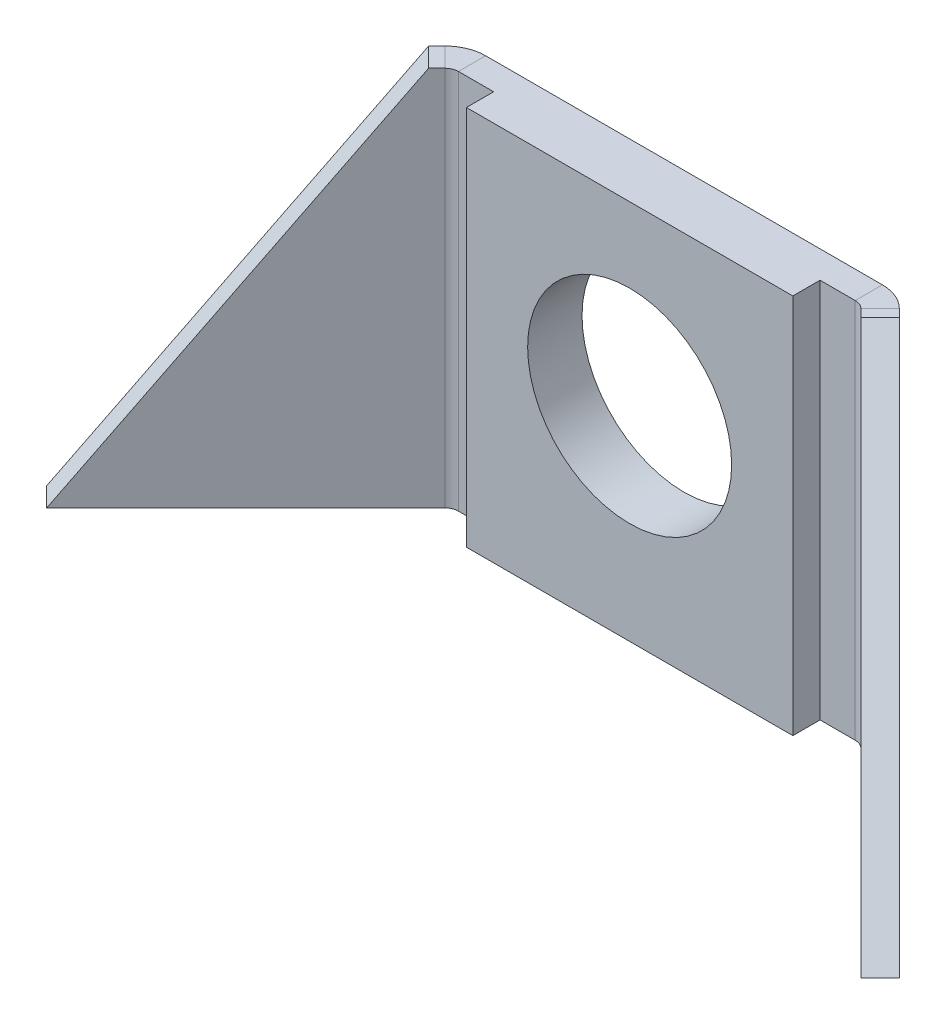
ISO-10303-21;
HEADER;
FILE_DESCRIPTION(('STEP AP214'),'2;1');
FILE_NAME('part.step','',(''),(''),'','','');
FILE_SCHEMA(('AUTOMOTIVE_DESIGN { 1 0 10303 214 1 1 1 1 }'));
ENDSEC;
DATA;
#1=APPLICATION_CONTEXT('core data for automotive mechanical design processes');
#2=APPLICATION_PROTOCOL_DEFINITION('international standard','automotive_design',2000,#1);
#3=PRODUCT_CONTEXT('',#1,'mechanical');
#4=PRODUCT('Part','Part','',(#3));
#5=PRODUCT_RELATED_PRODUCT_CATEGORY('part','',(#4));
#6=PRODUCT_DEFINITION_FORMATION('','',#4);
#7=PRODUCT_DEFINITION_CONTEXT('part definition',#1,'design');
#8=PRODUCT_DEFINITION('design','',#6,#7);
#9=PRODUCT_DEFINITION_SHAPE('','',#8);
#10=(LENGTH_UNIT() NAMED_UNIT(*) SI_UNIT(.MILLI.,.METRE.));
#11=(NAMED_UNIT(*) PLANE_ANGLE_UNIT() SI_UNIT($,.RADIAN.));
#12=(NAMED_UNIT(*) SI_UNIT($,.STERADIAN.) SOLID_ANGLE_UNIT());
#13=UNCERTAINTY_MEASURE_WITH_UNIT(LENGTH_MEASURE(1.E-05),#10,'distance_accuracy_value','');
#14=(GEOMETRIC_REPRESENTATION_CONTEXT(3) GLOBAL_UNCERTAINTY_ASSIGNED_CONTEXT((#13)) GLOBAL_UNIT_ASSIGNED_CONTEXT((#10,
#11,#12)) REPRESENTATION_CONTEXT('',''));
#15=CARTESIAN_POINT('',(0.,0.,0.));
#16=DIRECTION('',(0.,0.,1.));
#17=DIRECTION('',(1.,0.,0.));
#18=AXIS2_PLACEMENT_3D('',#15,#16,#17);
#19=CARTESIAN_POINT('',(0.,0.,0.));
#20=DIRECTION('',(0.,0.,1.));
#21=DIRECTION('',(1.,0.,0.));
#22=AXIS2_PLACEMENT_3D('',#19,#20,#21);
#23=PLANE('',#22);
#24=DIRECTION('',(1.,0.,0.));
#25=VECTOR('',#24,1.);
#26=CARTESIAN_POINT('',(-53.975,0.,0.));
#27=LINE('',#26,#25);
#28=CARTESIAN_POINT('',(-46.3098719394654,0.,0.));
#29=VERTEX_POINT('',#28);
#30=CARTESIAN_POINT('',(-38.1,0.,0.));
#31=VERTEX_POINT('',#30);
#32=EDGE_CURVE('E329',#29,#31,#27,.T.);
#33=ORIENTED_EDGE('',*,*,#32,.T.);
#34=DIRECTION('',(0.,-1.,0.));
#35=VECTOR('',#34,1.);
#36=CARTESIAN_POINT('',(-38.1,88.9,0.));
#37=LINE('',#36,#35);
#38=CARTESIAN_POINT('',(-38.1,88.9,0.));
#39=VERTEX_POINT('',#38);
#40=EDGE_CURVE('E79',#39,#31,#37,.T.);
#41=ORIENTED_EDGE('',*,*,#40,.F.);
#42=DIRECTION('',(-1.,0.,0.));
#43=VECTOR('',#42,1.);
#44=CARTESIAN_POINT('',(53.975,88.9,0.));
#45=LINE('',#44,#43);
#46=CARTESIAN_POINT('',(-46.3098719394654,88.9,0.));
#47=VERTEX_POINT('',#46);
#48=EDGE_CURVE('E289',#39,#47,#45,.T.);
#49=ORIENTED_EDGE('',*,*,#48,.T.);
#50=DIRECTION('',(0.,1.,0.));
#51=VECTOR('',#50,1.);
#52=CARTESIAN_POINT('',(-46.3098719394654,0.,0.));
#53=LINE('',#52,#51);
#54=EDGE_CURVE('E299',#29,#47,#53,.T.);
#55=ORIENTED_EDGE('',*,*,#54,.F.);
#56=EDGE_LOOP('',(#33,#41,#49,#55));
#57=FACE_BOUND('',#56,.T.);
#58=ADVANCED_FACE('F62',(#57),#23,.T.);
#59=CARTESIAN_POINT('',(46.3098719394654,88.9,0.));
#60=VERTEX_POINT('',#59);
#61=CARTESIAN_POINT('',(38.1,88.9,0.));
#62=VERTEX_POINT('',#61);
#63=EDGE_CURVE('E87',#60,#62,#45,.T.);
#64=ORIENTED_EDGE('',*,*,#63,.T.);
#65=DIRECTION('',(0.,1.,0.));
#66=VECTOR('',#65,1.);
#67=CARTESIAN_POINT('',(38.1,88.9,0.));
#68=LINE('',#67,#66);
#69=CARTESIAN_POINT('',(38.1,0.,0.));
#70=VERTEX_POINT('',#69);
#71=EDGE_CURVE('E198',#70,#62,#68,.T.);
#72=ORIENTED_EDGE('',*,*,#71,.F.);
#73=CARTESIAN_POINT('',(46.3098719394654,0.,0.));
#74=VERTEX_POINT('',#73);
#75=EDGE_CURVE('E330',#70,#74,#27,.T.);
#76=ORIENTED_EDGE('',*,*,#75,.T.);
#77=DIRECTION('',(0.,1.,0.));
#78=VECTOR('',#77,1.);
#79=CARTESIAN_POINT('',(46.3098719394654,0.,0.));
#80=LINE('',#79,#78);
#81=EDGE_CURVE('E71',#74,#60,#80,.T.);
#82=ORIENTED_EDGE('',*,*,#81,.T.);
#83=EDGE_LOOP('',(#64,#72,#76,#82));
#84=FACE_BOUND('',#83,.T.);
#85=ADVANCED_FACE('F332',(#84),#23,.T.);
#86=CARTESIAN_POINT('',(53.975,88.9,-6.35));
#87=DIRECTION('',(0.,1.,0.));
#88=DIRECTION('',(-1.,0.,0.));
#89=AXIS2_PLACEMENT_3D('',#86,#87,#88);
#90=PLANE('',#89);
#91=ORIENTED_EDGE('',*,*,#63,.F.);
#92=DIRECTION('',(0.,0.,-1.));
#93=VECTOR('',#92,1.);
#94=CARTESIAN_POINT('',(46.3098719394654,88.9,-6.35));
#95=LINE('',#94,#93);
#96=CARTESIAN_POINT('',(46.3098719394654,88.9,-6.35));
#97=VERTEX_POINT('',#96);
#98=EDGE_CURVE('E308',#60,#97,#95,.T.);
#99=ORIENTED_EDGE('',*,*,#98,.T.);
#100=DIRECTION('',(-1.,0.,0.));
#101=VECTOR('',#100,1.);
#102=CARTESIAN_POINT('',(53.975,88.9,-6.35));
#103=LINE('',#102,#101);
#104=CARTESIAN_POINT('',(-46.3098719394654,88.8999999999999,-6.35));
#105=VERTEX_POINT('',#104);
#106=EDGE_CURVE('E66',#97,#105,#103,.T.);
#107=ORIENTED_EDGE('',*,*,#106,.T.);
#108=DIRECTION('',(0.,0.,-1.));
#109=VECTOR('',#108,1.);
#110=CARTESIAN_POINT('',(-46.3098719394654,88.9,-6.35));
#111=LINE('',#110,#109);
#112=EDGE_CURVE('E302',#47,#105,#111,.T.);
#113=ORIENTED_EDGE('',*,*,#112,.F.);
#114=ORIENTED_EDGE('',*,*,#48,.F.);
#115=DIRECTION('',(0.,0.,-1.));
#116=VECTOR('',#115,1.);
#117=CARTESIAN_POINT('',(-38.1,88.9,6.35));
#118=LINE('',#117,#116);
#119=CARTESIAN_POINT('',(-38.1,88.9,6.35));
#120=VERTEX_POINT('',#119);
#121=EDGE_CURVE('E562',#120,#39,#118,.T.);
#122=ORIENTED_EDGE('',*,*,#121,.F.);
#123=DIRECTION('',(-1.,0.,0.));
#124=VECTOR('',#123,1.);
#125=CARTESIAN_POINT('',(-38.1,88.9,6.35));
#126=LINE('',#125,#124);
#127=CARTESIAN_POINT('',(38.1,88.9,6.35));
#128=VERTEX_POINT('',#127);
#129=EDGE_CURVE('E194',#128,#120,#126,.T.);
#130=ORIENTED_EDGE('',*,*,#129,.F.);
#131=DIRECTION('',(0.,0.,-1.));
#132=VECTOR('',#131,1.);
#133=CARTESIAN_POINT('',(38.1,88.9,6.35));
#134=LINE('',#133,#132);
#135=EDGE_CURVE('E206',#128,#62,#134,.T.);
#136=ORIENTED_EDGE('',*,*,#135,.T.);
#137=EDGE_LOOP('',(#91,#99,#107,#113,#114,#122,#130,#136));
#138=FACE_BOUND('',#137,.T.);
#139=ADVANCED_FACE('F387',(#138),#90,.T.);
#140=CARTESIAN_POINT('',(-53.975,0.,-6.35));
#141=DIRECTION('',(0.,-1.,0.));
#142=DIRECTION('',(0.,0.,-1.));
#143=AXIS2_PLACEMENT_3D('',#140,#141,#142);
#144=PLANE('',#143);
#145=DIRECTION('',(1.,0.,0.));
#146=VECTOR('',#145,1.);
#147=CARTESIAN_POINT('',(53.975,0.,-6.35));
#148=LINE('',#147,#146);
#149=CARTESIAN_POINT('',(-46.3098719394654,0.,-6.35));
#150=VERTEX_POINT('',#149);
#151=CARTESIAN_POINT('',(46.3098719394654,0.,-6.35));
#152=VERTEX_POINT('',#151);
#153=EDGE_CURVE('E327',#150,#152,#148,.T.);
#154=ORIENTED_EDGE('',*,*,#153,.T.);
#155=DIRECTION('',(0.,0.,1.));
#156=VECTOR('',#155,1.);
#157=CARTESIAN_POINT('',(46.3098719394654,0.,-6.35));
#158=LINE('',#157,#156);
#159=EDGE_CURVE('E14',#152,#74,#158,.T.);
#160=ORIENTED_EDGE('',*,*,#159,.T.);
#161=ORIENTED_EDGE('',*,*,#75,.F.);
#162=DIRECTION('',(0.,0.,-1.));
#163=VECTOR('',#162,1.);
#164=CARTESIAN_POINT('',(38.1,0.,6.35));
#165=LINE('',#164,#163);
#166=CARTESIAN_POINT('',(38.1,0.,6.35));
#167=VERTEX_POINT('',#166);
#168=EDGE_CURVE('E185',#167,#70,#165,.T.);
#169=ORIENTED_EDGE('',*,*,#168,.F.);
#170=DIRECTION('',(1.,0.,0.));
#171=VECTOR('',#170,1.);
#172=CARTESIAN_POINT('',(-38.1,0.,6.35));
#173=LINE('',#172,#171);
#174=CARTESIAN_POINT('',(-38.1,0.,6.35));
#175=VERTEX_POINT('',#174);
#176=EDGE_CURVE('E179',#175,#167,#173,.T.);
#177=ORIENTED_EDGE('',*,*,#176,.F.);
#178=DIRECTION('',(0.,0.,-1.));
#179=VECTOR('',#178,1.);
#180=CARTESIAN_POINT('',(-38.1,0.,6.35));
#181=LINE('',#180,#179);
#182=EDGE_CURVE('E183',#175,#31,#181,.T.);
#183=ORIENTED_EDGE('',*,*,#182,.T.);
#184=ORIENTED_EDGE('',*,*,#32,.F.);
#185=DIRECTION('',(0.,0.,1.));
#186=VECTOR('',#185,1.);
#187=CARTESIAN_POINT('',(-46.3098719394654,0.,-6.35));
#188=LINE('',#187,#186);
#189=EDGE_CURVE('E296',#150,#29,#188,.T.);
#190=ORIENTED_EDGE('',*,*,#189,.F.);
#191=EDGE_LOOP('',(#154,#160,#161,#169,#177,#183,#184,#190));
#192=FACE_BOUND('',#191,.T.);
#193=ADVANCED_FACE('F64',(#192),#144,.T.);
#194=CARTESIAN_POINT('',(0.,0.,-6.35));
#195=DIRECTION('',(0.,0.,1.));
#196=DIRECTION('',(1.,0.,0.));
#197=AXIS2_PLACEMENT_3D('',#194,#195,#196);
#198=PLANE('',#197);
#199=CARTESIAN_POINT('',(0.,47.625,-6.35));
#200=DIRECTION('',(0.,0.,1.));
#201=DIRECTION('',(1.,0.,0.));
#202=AXIS2_PLACEMENT_3D('',#199,#200,#201);
#203=CIRCLE('',#202,23.8125);
#204=CARTESIAN_POINT('',(23.8125,47.625,-6.35));
#205=VERTEX_POINT('',#204);
#206=EDGE_CURVE('E553',#205,#205,#203,.T.);
#207=ORIENTED_EDGE('',*,*,#206,.T.);
#208=EDGE_LOOP('',(#207));
#209=FACE_BOUND('',#208,.T.);
#210=DIRECTION('',(0.,1.,0.));
#211=VECTOR('',#210,1.);
#212=CARTESIAN_POINT('',(46.3098719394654,0.,-6.35));
#213=LINE('',#212,#211);
#214=EDGE_CURVE('E304',#152,#97,#213,.T.);
#215=ORIENTED_EDGE('',*,*,#214,.F.);
#216=ORIENTED_EDGE('',*,*,#153,.F.);
#217=DIRECTION('',(0.,1.,0.));
#218=VECTOR('',#217,1.);
#219=CARTESIAN_POINT('',(-46.3098719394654,0.,-6.35));
#220=LINE('',#219,#218);
#221=EDGE_CURVE('E294',#150,#105,#220,.T.);
#222=ORIENTED_EDGE('',*,*,#221,.T.);
#223=ORIENTED_EDGE('',*,*,#106,.F.);
#224=EDGE_LOOP('',(#215,#216,#222,#223));
#225=FACE_BOUND('',#224,.T.);
#226=ADVANCED_FACE('F345',(#209,#225),#198,.F.);
#227=CARTESIAN_POINT('',(-46.3098719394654,0.,3.175));
#228=DIRECTION('',(0.,-1.,0.));
#229=DIRECTION('',(1.,0.,0.));
#230=AXIS2_PLACEMENT_3D('',#227,#228,#229);
#231=PLANE('',#230);
#232=ORIENTED_EDGE('',*,*,#189,.T.);
#233=CARTESIAN_POINT('',(-46.3098719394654,0.,3.175));
#234=DIRECTION('',(0.,1.,0.));
#235=DIRECTION('',(-1.,0.,0.));
#236=AXIS2_PLACEMENT_3D('',#233,#234,#235);
#237=CIRCLE('',#236,3.175);
#238=CARTESIAN_POINT('',(-48.5549359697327,0.,0.929935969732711));
#239=VERTEX_POINT('',#238);
#240=EDGE_CURVE('E253',#29,#239,#237,.T.);
#241=ORIENTED_EDGE('',*,*,#240,.T.);
#242=DIRECTION('',(0.707106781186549,0.,0.707106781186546));
#243=VECTOR('',#242,1.);
#244=CARTESIAN_POINT('',(-53.0450640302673,0.,-3.56019209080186));
#245=LINE('',#244,#243);
#246=CARTESIAN_POINT('',(-53.0450640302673,0.,-3.56019209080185));
#247=VERTEX_POINT('',#246);
#248=EDGE_CURVE('E268',#247,#239,#245,.T.);
#249=ORIENTED_EDGE('',*,*,#248,.F.);
#250=CARTESIAN_POINT('',(-46.3098719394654,0.,3.175));
#251=DIRECTION('',(0.,1.,0.));
#252=DIRECTION('',(1.,0.,0.));
#253=AXIS2_PLACEMENT_3D('',#250,#251,#252);
#254=CIRCLE('',#253,9.525);
#255=EDGE_CURVE('E282',#150,#247,#254,.T.);
#256=ORIENTED_EDGE('',*,*,#255,.F.);
#257=EDGE_LOOP('',(#232,#241,#249,#256));
#258=FACE_BOUND('',#257,.T.);
#259=ADVANCED_FACE('F394',(#258),#231,.T.);
#260=CARTESIAN_POINT('',(-46.3098719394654,88.8999999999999,3.175));
#261=DIRECTION('',(0.,1.,0.));
#262=DIRECTION('',(0.,0.,1.));
#263=AXIS2_PLACEMENT_3D('',#260,#261,#262);
#264=PLANE('',#263);
#265=DIRECTION('',(-0.707106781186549,0.,-0.707106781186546));
#266=VECTOR('',#265,1.);
#267=CARTESIAN_POINT('',(-53.0450640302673,88.9,-3.56019209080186));
#268=LINE('',#267,#266);
#269=CARTESIAN_POINT('',(-48.5549359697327,88.9,0.929935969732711));
#270=VERTEX_POINT('',#269);
#271=CARTESIAN_POINT('',(-53.0450640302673,88.8999999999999,-3.56019209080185));
#272=VERTEX_POINT('',#271);
#273=EDGE_CURVE('E256',#270,#272,#268,.T.);
#274=ORIENTED_EDGE('',*,*,#273,.F.);
#275=CARTESIAN_POINT('',(-46.3098719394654,88.8999999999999,3.175));
#276=DIRECTION('',(0.,1.,0.));
#277=DIRECTION('',(-1.,0.,0.));
#278=AXIS2_PLACEMENT_3D('',#275,#276,#277);
#279=CIRCLE('',#278,3.175);
#280=EDGE_CURVE('E286',#270,#47,#279,.F.);
#281=ORIENTED_EDGE('',*,*,#280,.T.);
#282=ORIENTED_EDGE('',*,*,#112,.T.);
#283=CARTESIAN_POINT('',(-46.3098719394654,88.8999999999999,3.175));
#284=DIRECTION('',(0.,-1.,0.));
#285=DIRECTION('',(0.,0.,1.));
#286=AXIS2_PLACEMENT_3D('',#283,#284,#285);
#287=CIRCLE('',#286,9.525);
#288=EDGE_CURVE('E285',#272,#105,#287,.T.);
#289=ORIENTED_EDGE('',*,*,#288,.F.);
#290=EDGE_LOOP('',(#274,#281,#282,#289));
#291=FACE_BOUND('',#290,.T.);
#292=ADVANCED_FACE('F398',(#291),#264,.T.);
#293=CARTESIAN_POINT('',(-46.3098719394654,-44.8159254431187,3.175));
#294=DIRECTION('',(0.,1.,0.));
#295=DIRECTION('',(-1.,0.,0.));
#296=AXIS2_PLACEMENT_3D('',#293,#294,#295);
#297=CYLINDRICAL_SURFACE('',#296,9.525);
#298=ORIENTED_EDGE('',*,*,#288,.T.);
#299=ORIENTED_EDGE('',*,*,#221,.F.);
#300=ORIENTED_EDGE('',*,*,#255,.T.);
#301=DIRECTION('',(0.,1.,0.));
#302=VECTOR('',#301,1.);
#303=CARTESIAN_POINT('',(-53.0450640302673,0.,-3.56019209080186));
#304=LINE('',#303,#302);
#305=EDGE_CURVE('E245',#247,#272,#304,.T.);
#306=ORIENTED_EDGE('',*,*,#305,.T.);
#307=EDGE_LOOP('',(#298,#299,#300,#306));
#308=FACE_BOUND('',#307,.T.);
#309=ADVANCED_FACE('F402',(#308),#297,.T.);
#310=CARTESIAN_POINT('',(-46.3098719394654,-44.8159254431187,3.175));
#311=DIRECTION('',(0.,1.,0.));
#312=DIRECTION('',(-1.,0.,0.));
#313=AXIS2_PLACEMENT_3D('',#310,#311,#312);
#314=CYLINDRICAL_SURFACE('',#313,3.175);
#315=ORIENTED_EDGE('',*,*,#280,.F.);
#316=DIRECTION('',(0.,1.,0.));
#317=VECTOR('',#316,1.);
#318=CARTESIAN_POINT('',(-48.5549359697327,0.,0.929935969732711));
#319=LINE('',#318,#317);
#320=EDGE_CURVE('E263',#239,#270,#319,.T.);
#321=ORIENTED_EDGE('',*,*,#320,.F.);
#322=ORIENTED_EDGE('',*,*,#240,.F.);
#323=ORIENTED_EDGE('',*,*,#54,.T.);
#324=EDGE_LOOP('',(#315,#321,#322,#323));
#325=FACE_BOUND('',#324,.T.);
#326=ADVANCED_FACE('F404',(#325),#314,.F.);
#327=CARTESIAN_POINT('',(-99.5209191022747,0.,42.9156629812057));
#328=DIRECTION('',(-0.576777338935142,0.578494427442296,0.576777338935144));
#329=DIRECTION('',(-0.409057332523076,-0.815686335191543,0.409057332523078));
#330=AXIS2_PLACEMENT_3D('',#327,#328,#329);
#331=PLANE('',#330);
#332=DIRECTION('',(-0.409057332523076,-0.815686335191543,0.409057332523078));
#333=VECTOR('',#332,1.);
#334=CARTESIAN_POINT('',(-95.0307910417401,0.,47.4057910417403));
#335=LINE('',#334,#333);
#336=CARTESIAN_POINT('',(-50.4484616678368,88.9,2.82346166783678));
#337=VERTEX_POINT('',#336);
#338=CARTESIAN_POINT('',(-95.0307910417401,0.,47.4057910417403));
#339=VERTEX_POINT('',#338);
#340=EDGE_CURVE('E258',#337,#339,#335,.T.);
#341=ORIENTED_EDGE('',*,*,#340,.F.);
#342=DIRECTION('',(0.707106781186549,0.,0.707106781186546));
#343=VECTOR('',#342,1.);
#344=CARTESIAN_POINT('',(-54.9385897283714,88.9,-1.66666639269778));
#345=LINE('',#344,#343);
#346=CARTESIAN_POINT('',(-54.9385897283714,88.9,-1.66666639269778));
#347=VERTEX_POINT('',#346);
#348=EDGE_CURVE('E250',#347,#337,#345,.T.);
#349=ORIENTED_EDGE('',*,*,#348,.F.);
#350=DIRECTION('',(-0.409057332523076,-0.815686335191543,0.409057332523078));
#351=VECTOR('',#350,1.);
#352=CARTESIAN_POINT('',(-99.5209191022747,0.,42.9156629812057));
#353=LINE('',#352,#351);
#354=CARTESIAN_POINT('',(-99.5209191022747,0.,42.9156629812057));
#355=VERTEX_POINT('',#354);
#356=EDGE_CURVE('E277',#347,#355,#353,.T.);
#357=ORIENTED_EDGE('',*,*,#356,.T.);
#358=DIRECTION('',(0.707106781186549,0.,0.707106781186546));
#359=VECTOR('',#358,1.);
#360=CARTESIAN_POINT('',(-99.5209191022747,0.,42.9156629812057));
#361=LINE('',#360,#359);
#362=EDGE_CURVE('E274',#355,#339,#361,.T.);
#363=ORIENTED_EDGE('',*,*,#362,.T.);
#364=EDGE_LOOP('',(#341,#349,#357,#363));
#365=FACE_BOUND('',#364,.T.);
#366=ADVANCED_FACE('F407',(#365),#331,.T.);
#367=CARTESIAN_POINT('',(-16.7725012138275,0.,-39.8327549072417));
#368=DIRECTION('',(0.707106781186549,0.,0.707106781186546));
#369=DIRECTION('',(0.707106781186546,0.,-0.707106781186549));
#370=AXIS2_PLACEMENT_3D('',#367,#368,#369);
#371=PLANE('',#370);
#372=ORIENTED_EDGE('',*,*,#305,.F.);
#373=DIRECTION('',(0.707106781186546,0.,-0.707106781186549));
#374=VECTOR('',#373,1.);
#375=CARTESIAN_POINT('',(21.3935873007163,0.,-77.9988434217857));
#376=LINE('',#375,#374);
#377=EDGE_CURVE('E271',#355,#247,#376,.T.);
#378=ORIENTED_EDGE('',*,*,#377,.F.);
#379=ORIENTED_EDGE('',*,*,#356,.F.);
#380=DIRECTION('',(-0.707106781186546,0.,0.707106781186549));
#381=VECTOR('',#380,1.);
#382=CARTESIAN_POINT('',(21.3935873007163,88.9,-77.9988434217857));
#383=LINE('',#382,#381);
#384=EDGE_CURVE('E254',#272,#347,#383,.T.);
#385=ORIENTED_EDGE('',*,*,#384,.F.);
#386=EDGE_LOOP('',(#372,#378,#379,#385));
#387=FACE_BOUND('',#386,.T.);
#388=ADVANCED_FACE('F423',(#387),#371,.F.);
#389=CARTESIAN_POINT('',(-54.9385897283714,0.,-1.66666639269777));
#390=DIRECTION('',(0.,-1.,0.));
#391=DIRECTION('',(-0.707106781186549,0.,-0.707106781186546));
#392=AXIS2_PLACEMENT_3D('',#389,#390,#391);
#393=PLANE('',#392);
#394=ORIENTED_EDGE('',*,*,#377,.T.);
#395=ORIENTED_EDGE('',*,*,#248,.T.);
#396=DIRECTION('',(0.707106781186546,0.,-0.707106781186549));
#397=VECTOR('',#396,1.);
#398=CARTESIAN_POINT('',(-50.4484616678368,0.,2.82346166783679));
#399=LINE('',#398,#397);
#400=EDGE_CURVE('E266',#339,#239,#399,.T.);
#401=ORIENTED_EDGE('',*,*,#400,.F.);
#402=ORIENTED_EDGE('',*,*,#362,.F.);
#403=EDGE_LOOP('',(#394,#395,#401,#402));
#404=FACE_BOUND('',#403,.T.);
#405=ADVANCED_FACE('F419',(#404),#393,.T.);
#406=CARTESIAN_POINT('',(-12.2823731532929,0.,-35.3426268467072));
#407=DIRECTION('',(0.707106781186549,0.,0.707106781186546));
#408=DIRECTION('',(0.707106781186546,0.,-0.707106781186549));
#409=AXIS2_PLACEMENT_3D('',#406,#407,#408);
#410=PLANE('',#409);
#411=ORIENTED_EDGE('',*,*,#400,.T.);
#412=ORIENTED_EDGE('',*,*,#320,.T.);
#413=DIRECTION('',(-0.707106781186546,0.,0.707106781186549));
#414=VECTOR('',#413,1.);
#415=CARTESIAN_POINT('',(25.8837153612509,88.9,-73.5087153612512));
#416=LINE('',#415,#414);
#417=EDGE_CURVE('E261',#270,#337,#416,.T.);
#418=ORIENTED_EDGE('',*,*,#417,.T.);
#419=ORIENTED_EDGE('',*,*,#340,.T.);
#420=EDGE_LOOP('',(#411,#412,#418,#419));
#421=FACE_BOUND('',#420,.T.);
#422=ADVANCED_FACE('F415',(#421),#410,.T.);
#423=CARTESIAN_POINT('',(21.3935873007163,88.9,-77.9988434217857));
#424=DIRECTION('',(0.,1.,0.));
#425=DIRECTION('',(-0.707106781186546,0.,0.707106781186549));
#426=AXIS2_PLACEMENT_3D('',#423,#424,#425);
#427=PLANE('',#426);
#428=ORIENTED_EDGE('',*,*,#417,.F.);
#429=ORIENTED_EDGE('',*,*,#273,.T.);
#430=ORIENTED_EDGE('',*,*,#384,.T.);
#431=ORIENTED_EDGE('',*,*,#348,.T.);
#432=EDGE_LOOP('',(#428,#429,#430,#431));
#433=FACE_BOUND('',#432,.T.);
#434=ADVANCED_FACE('F412',(#433),#427,.T.);
#435=CARTESIAN_POINT('',(46.3098719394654,0.,3.175));
#436=DIRECTION('',(0.,-1.,0.));
#437=DIRECTION('',(1.,0.,0.));
#438=AXIS2_PLACEMENT_3D('',#435,#436,#437);
#439=PLANE('',#438);
#440=DIRECTION('',(-0.707106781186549,0.,0.707106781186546));
#441=VECTOR('',#440,1.);
#442=CARTESIAN_POINT('',(53.0450640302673,0.,-3.56019209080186));
#443=LINE('',#442,#441);
#444=CARTESIAN_POINT('',(53.0450640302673,0.,-3.56019209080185));
#445=VERTEX_POINT('',#444);
#446=CARTESIAN_POINT('',(48.5549359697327,0.,0.929935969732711));
#447=VERTEX_POINT('',#446);
#448=EDGE_CURVE('E201',#445,#447,#443,.T.);
#449=ORIENTED_EDGE('',*,*,#448,.T.);
#450=CARTESIAN_POINT('',(46.3098719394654,1.11022302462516E-13,3.175));
#451=DIRECTION('',(0.,-1.,0.));
#452=DIRECTION('',(1.,0.,0.));
#453=AXIS2_PLACEMENT_3D('',#450,#451,#452);
#454=CIRCLE('',#453,3.175);
#455=EDGE_CURVE('E213',#447,#74,#454,.F.);
#456=ORIENTED_EDGE('',*,*,#455,.T.);
#457=ORIENTED_EDGE('',*,*,#159,.F.);
#458=CARTESIAN_POINT('',(46.3098719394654,0.,3.175));
#459=DIRECTION('',(0.,1.,0.));
#460=DIRECTION('',(1.,0.,0.));
#461=AXIS2_PLACEMENT_3D('',#458,#459,#460);
#462=CIRCLE('',#461,9.525);
#463=EDGE_CURVE('E238',#445,#152,#462,.T.);
#464=ORIENTED_EDGE('',*,*,#463,.F.);
#465=EDGE_LOOP('',(#449,#456,#457,#464));
#466=FACE_BOUND('',#465,.T.);
#467=ADVANCED_FACE('F336',(#466),#439,.T.);
#468=CARTESIAN_POINT('',(46.3098719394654,88.9,3.175));
#469=DIRECTION('',(0.,1.,0.));
#470=DIRECTION('',(0.,0.,1.));
#471=AXIS2_PLACEMENT_3D('',#468,#469,#470);
#472=PLANE('',#471);
#473=CARTESIAN_POINT('',(46.3098719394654,88.9,3.175));
#474=DIRECTION('',(0.,-1.,0.));
#475=DIRECTION('',(1.,0.,0.));
#476=AXIS2_PLACEMENT_3D('',#473,#474,#475);
#477=CIRCLE('',#476,3.175);
#478=CARTESIAN_POINT('',(48.5549359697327,88.9,0.929935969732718));
#479=VERTEX_POINT('',#478);
#480=EDGE_CURVE('E242',#60,#479,#477,.T.);
#481=ORIENTED_EDGE('',*,*,#480,.T.);
#482=DIRECTION('',(0.707106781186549,0.,-0.707106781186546));
#483=VECTOR('',#482,1.);
#484=CARTESIAN_POINT('',(53.0450640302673,88.9,-3.56019209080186));
#485=LINE('',#484,#483);
#486=CARTESIAN_POINT('',(53.0450640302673,88.9,-3.56019209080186));
#487=VERTEX_POINT('',#486);
#488=EDGE_CURVE('E233',#479,#487,#485,.T.);
#489=ORIENTED_EDGE('',*,*,#488,.T.);
#490=CARTESIAN_POINT('',(46.3098719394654,88.9,3.175));
#491=DIRECTION('',(0.,-1.,0.));
#492=DIRECTION('',(0.,0.,1.));
#493=AXIS2_PLACEMENT_3D('',#490,#491,#492);
#494=CIRCLE('',#493,9.525);
#495=EDGE_CURVE('E241',#97,#487,#494,.T.);
#496=ORIENTED_EDGE('',*,*,#495,.F.);
#497=ORIENTED_EDGE('',*,*,#98,.F.);
#498=EDGE_LOOP('',(#481,#489,#496,#497));
#499=FACE_BOUND('',#498,.T.);
#500=ADVANCED_FACE('F354',(#499),#472,.T.);
#501=CARTESIAN_POINT('',(46.3098719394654,133.715925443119,3.175));
#502=DIRECTION('',(0.,-1.,0.));
#503=DIRECTION('',(1.,0.,0.));
#504=AXIS2_PLACEMENT_3D('',#501,#502,#503);
#505=CYLINDRICAL_SURFACE('',#504,9.525);
#506=ORIENTED_EDGE('',*,*,#214,.T.);
#507=ORIENTED_EDGE('',*,*,#495,.T.);
#508=DIRECTION('',(0.,1.,0.));
#509=VECTOR('',#508,1.);
#510=CARTESIAN_POINT('',(53.0450640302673,0.,-3.56019209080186));
#511=LINE('',#510,#509);
#512=EDGE_CURVE('E226',#445,#487,#511,.T.);
#513=ORIENTED_EDGE('',*,*,#512,.F.);
#514=ORIENTED_EDGE('',*,*,#463,.T.);
#515=EDGE_LOOP('',(#506,#507,#513,#514));
#516=FACE_BOUND('',#515,.T.);
#517=ADVANCED_FACE('F351',(#516),#505,.T.);
#518=CARTESIAN_POINT('',(46.3098719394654,133.715925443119,3.175));
#519=DIRECTION('',(0.,-1.,0.));
#520=DIRECTION('',(1.,0.,0.));
#521=AXIS2_PLACEMENT_3D('',#518,#519,#520);
#522=CYLINDRICAL_SURFACE('',#521,3.175);
#523=ORIENTED_EDGE('',*,*,#81,.F.);
#524=ORIENTED_EDGE('',*,*,#455,.F.);
#525=DIRECTION('',(0.,1.,0.));
#526=VECTOR('',#525,1.);
#527=CARTESIAN_POINT('',(48.5549359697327,0.,0.929935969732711));
#528=LINE('',#527,#526);
#529=EDGE_CURVE('E204',#447,#479,#528,.T.);
#530=ORIENTED_EDGE('',*,*,#529,.T.);
#531=ORIENTED_EDGE('',*,*,#480,.F.);
#532=EDGE_LOOP('',(#523,#524,#530,#531));
#533=FACE_BOUND('',#532,.T.);
#534=ADVANCED_FACE('F340',(#533),#522,.F.);
#535=CARTESIAN_POINT('',(99.5209191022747,0.,42.9156629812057));
#536=DIRECTION('',(0.576777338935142,0.578494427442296,0.576777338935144));
#537=DIRECTION('',(-0.409057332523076,0.815686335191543,-0.409057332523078));
#538=AXIS2_PLACEMENT_3D('',#535,#536,#537);
#539=PLANE('',#538);
#540=DIRECTION('',(-0.409057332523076,0.815686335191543,-0.409057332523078));
#541=VECTOR('',#540,1.);
#542=CARTESIAN_POINT('',(95.0307910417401,0.,47.4057910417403));
#543=LINE('',#542,#541);
#544=CARTESIAN_POINT('',(95.0307910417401,0.,47.4057910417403));
#545=VERTEX_POINT('',#544);
#546=CARTESIAN_POINT('',(50.4484616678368,88.9,2.82346166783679));
#547=VERTEX_POINT('',#546);
#548=EDGE_CURVE('E218',#545,#547,#543,.T.);
#549=ORIENTED_EDGE('',*,*,#548,.F.);
#550=DIRECTION('',(-0.707106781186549,0.,0.707106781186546));
#551=VECTOR('',#550,1.);
#552=CARTESIAN_POINT('',(99.5209191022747,0.,42.9156629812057));
#553=LINE('',#552,#551);
#554=CARTESIAN_POINT('',(99.5209191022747,0.,42.9156629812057));
#555=VERTEX_POINT('',#554);
#556=EDGE_CURVE('E210',#555,#545,#553,.T.);
#557=ORIENTED_EDGE('',*,*,#556,.F.);
#558=DIRECTION('',(-0.409057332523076,0.815686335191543,-0.409057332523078));
#559=VECTOR('',#558,1.);
#560=CARTESIAN_POINT('',(99.5209191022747,0.,42.9156629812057));
#561=LINE('',#560,#559);
#562=CARTESIAN_POINT('',(54.9385897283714,88.9,-1.66666639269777));
#563=VERTEX_POINT('',#562);
#564=EDGE_CURVE('E230',#555,#563,#561,.T.);
#565=ORIENTED_EDGE('',*,*,#564,.T.);
#566=DIRECTION('',(-0.707106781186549,0.,0.707106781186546));
#567=VECTOR('',#566,1.);
#568=CARTESIAN_POINT('',(54.9385897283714,88.9,-1.66666639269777));
#569=LINE('',#568,#567);
#570=EDGE_CURVE('E228',#563,#547,#569,.T.);
#571=ORIENTED_EDGE('',*,*,#570,.T.);
#572=EDGE_LOOP('',(#549,#557,#565,#571));
#573=FACE_BOUND('',#572,.T.);
#574=ADVANCED_FACE('F366',(#573),#539,.T.);
#575=CARTESIAN_POINT('',(16.7725012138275,0.,-39.8327549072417));
#576=DIRECTION('',(-0.707106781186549,0.,0.707106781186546));
#577=DIRECTION('',(0.707106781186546,0.,0.707106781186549));
#578=AXIS2_PLACEMENT_3D('',#575,#576,#577);
#579=PLANE('',#578);
#580=DIRECTION('',(0.707106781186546,0.,0.707106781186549));
#581=VECTOR('',#580,1.);
#582=CARTESIAN_POINT('',(54.9385897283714,0.,-1.66666639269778));
#583=LINE('',#582,#581);
#584=EDGE_CURVE('E214',#445,#555,#583,.T.);
#585=ORIENTED_EDGE('',*,*,#584,.F.);
#586=ORIENTED_EDGE('',*,*,#512,.T.);
#587=DIRECTION('',(-0.707106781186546,0.,-0.707106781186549));
#588=VECTOR('',#587,1.);
#589=CARTESIAN_POINT('',(54.9385897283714,88.9,-1.66666639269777));
#590=LINE('',#589,#588);
#591=EDGE_CURVE('E223',#563,#487,#590,.T.);
#592=ORIENTED_EDGE('',*,*,#591,.F.);
#593=ORIENTED_EDGE('',*,*,#564,.F.);
#594=EDGE_LOOP('',(#585,#586,#592,#593));
#595=FACE_BOUND('',#594,.T.);
#596=ADVANCED_FACE('F370',(#595),#579,.F.);
#597=CARTESIAN_POINT('',(54.9385897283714,88.9,-1.66666639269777));
#598=DIRECTION('',(0.,1.,0.));
#599=DIRECTION('',(-0.707106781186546,0.,-0.707106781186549));
#600=AXIS2_PLACEMENT_3D('',#597,#598,#599);
#601=PLANE('',#600);
#602=ORIENTED_EDGE('',*,*,#488,.F.);
#603=DIRECTION('',(-0.707106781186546,0.,-0.707106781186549));
#604=VECTOR('',#603,1.);
#605=CARTESIAN_POINT('',(50.4484616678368,88.9,2.82346166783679));
#606=LINE('',#605,#604);
#607=EDGE_CURVE('E216',#547,#479,#606,.T.);
#608=ORIENTED_EDGE('',*,*,#607,.F.);
#609=ORIENTED_EDGE('',*,*,#570,.F.);
#610=ORIENTED_EDGE('',*,*,#591,.T.);
#611=EDGE_LOOP('',(#602,#608,#609,#610));
#612=FACE_BOUND('',#611,.T.);
#613=ADVANCED_FACE('F358',(#612),#601,.T.);
#614=CARTESIAN_POINT('',(12.2823731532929,0.,-35.3426268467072));
#615=DIRECTION('',(-0.707106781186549,0.,0.707106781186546));
#616=DIRECTION('',(0.707106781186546,0.,0.707106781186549));
#617=AXIS2_PLACEMENT_3D('',#614,#615,#616);
#618=PLANE('',#617);
#619=ORIENTED_EDGE('',*,*,#529,.F.);
#620=DIRECTION('',(0.707106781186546,0.,0.707106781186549));
#621=VECTOR('',#620,1.);
#622=CARTESIAN_POINT('',(-25.8837153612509,0.,-73.5087153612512));
#623=LINE('',#622,#621);
#624=EDGE_CURVE('E221',#447,#545,#623,.T.);
#625=ORIENTED_EDGE('',*,*,#624,.T.);
#626=ORIENTED_EDGE('',*,*,#548,.T.);
#627=ORIENTED_EDGE('',*,*,#607,.T.);
#628=EDGE_LOOP('',(#619,#625,#626,#627));
#629=FACE_BOUND('',#628,.T.);
#630=ADVANCED_FACE('F362',(#629),#618,.T.);
#631=CARTESIAN_POINT('',(-21.3935873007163,0.,-77.9988434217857));
#632=DIRECTION('',(0.,-1.,0.));
#633=DIRECTION('',(0.707106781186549,0.,-0.707106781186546));
#634=AXIS2_PLACEMENT_3D('',#631,#632,#633);
#635=PLANE('',#634);
#636=ORIENTED_EDGE('',*,*,#448,.F.);
#637=ORIENTED_EDGE('',*,*,#584,.T.);
#638=ORIENTED_EDGE('',*,*,#556,.T.);
#639=ORIENTED_EDGE('',*,*,#624,.F.);
#640=EDGE_LOOP('',(#636,#637,#638,#639));
#641=FACE_BOUND('',#640,.T.);
#642=ADVANCED_FACE('F372',(#641),#635,.T.);
#643=CARTESIAN_POINT('',(-38.1,88.9,6.35));
#644=DIRECTION('',(1.,0.,0.));
#645=DIRECTION('',(0.,1.,0.));
#646=AXIS2_PLACEMENT_3D('',#643,#644,#645);
#647=PLANE('',#646);
#648=ORIENTED_EDGE('',*,*,#40,.T.);
#649=ORIENTED_EDGE('',*,*,#182,.F.);
#650=DIRECTION('',(0.,-1.,0.));
#651=VECTOR('',#650,1.);
#652=CARTESIAN_POINT('',(-38.1,88.9,6.35));
#653=LINE('',#652,#651);
#654=EDGE_CURVE('E189',#120,#175,#653,.T.);
#655=ORIENTED_EDGE('',*,*,#654,.F.);
#656=ORIENTED_EDGE('',*,*,#121,.T.);
#657=EDGE_LOOP('',(#648,#649,#655,#656));
#658=FACE_BOUND('',#657,.T.);
#659=ADVANCED_FACE('F200',(#658),#647,.F.);
#660=CARTESIAN_POINT('',(38.1,88.9,6.35));
#661=DIRECTION('',(-1.,0.,0.));
#662=DIRECTION('',(0.,-1.,0.));
#663=AXIS2_PLACEMENT_3D('',#660,#661,#662);
#664=PLANE('',#663);
#665=ORIENTED_EDGE('',*,*,#71,.T.);
#666=ORIENTED_EDGE('',*,*,#135,.F.);
#667=DIRECTION('',(0.,1.,0.));
#668=VECTOR('',#667,1.);
#669=CARTESIAN_POINT('',(38.1,88.9,6.35));
#670=LINE('',#669,#668);
#671=EDGE_CURVE('E188',#167,#128,#670,.T.);
#672=ORIENTED_EDGE('',*,*,#671,.F.);
#673=ORIENTED_EDGE('',*,*,#168,.T.);
#674=EDGE_LOOP('',(#665,#666,#672,#673));
#675=FACE_BOUND('',#674,.T.);
#676=ADVANCED_FACE('F379',(#675),#664,.F.);
#677=CARTESIAN_POINT('',(0.,0.,6.35));
#678=DIRECTION('',(0.,0.,1.));
#679=DIRECTION('',(1.,0.,0.));
#680=AXIS2_PLACEMENT_3D('',#677,#678,#679);
#681=PLANE('',#680);
#682=CARTESIAN_POINT('',(0.,47.625,6.35));
#683=DIRECTION('',(0.,0.,1.));
#684=DIRECTION('',(1.,0.,0.));
#685=AXIS2_PLACEMENT_3D('',#682,#683,#684);
#686=CIRCLE('',#685,23.8125);
#687=CARTESIAN_POINT('',(23.8125,47.625,6.35));
#688=VERTEX_POINT('',#687);
#689=EDGE_CURVE('E556',#688,#688,#686,.T.);
#690=ORIENTED_EDGE('',*,*,#689,.F.);
#691=EDGE_LOOP('',(#690));
#692=FACE_BOUND('',#691,.T.);
#693=ORIENTED_EDGE('',*,*,#654,.T.);
#694=ORIENTED_EDGE('',*,*,#176,.T.);
#695=ORIENTED_EDGE('',*,*,#671,.T.);
#696=ORIENTED_EDGE('',*,*,#129,.T.);
#697=EDGE_LOOP('',(#693,#694,#695,#696));
#698=FACE_BOUND('',#697,.T.);
#699=ADVANCED_FACE('F192',(#692,#698),#681,.T.);
#700=CARTESIAN_POINT('',(0.,47.625,-6.35));
#701=DIRECTION('',(0.,0.,1.));
#702=DIRECTION('',(1.,0.,0.));
#703=AXIS2_PLACEMENT_3D('',#700,#701,#702);
#704=CYLINDRICAL_SURFACE('',#703,23.8125);
#705=ORIENTED_EDGE('',*,*,#206,.F.);
#706=EDGE_LOOP('',(#705));
#707=FACE_BOUND('',#706,.T.);
#708=ORIENTED_EDGE('',*,*,#689,.T.);
#709=EDGE_LOOP('',(#708));
#710=FACE_BOUND('',#709,.T.);
#711=ADVANCED_FACE('F536',(#707,#710),#704,.F.);
#712=CLOSED_SHELL('',(#58,#85,#139,#193,#226,#259,#292,#309,#326,#366,#388,#405,#422,#434,#467,
#500,#517,#534,#574,#596,#613,#630,#642,#659,#676,#699,#711));
#713=MANIFOLD_SOLID_BREP('B2',#712);
#714=ADVANCED_BREP_SHAPE_REPRESENTATION('',(#18,#713),#14);
#715=SHAPE_DEFINITION_REPRESENTATION(#9,#714);
ENDSEC;
END-ISO-10303-21;
